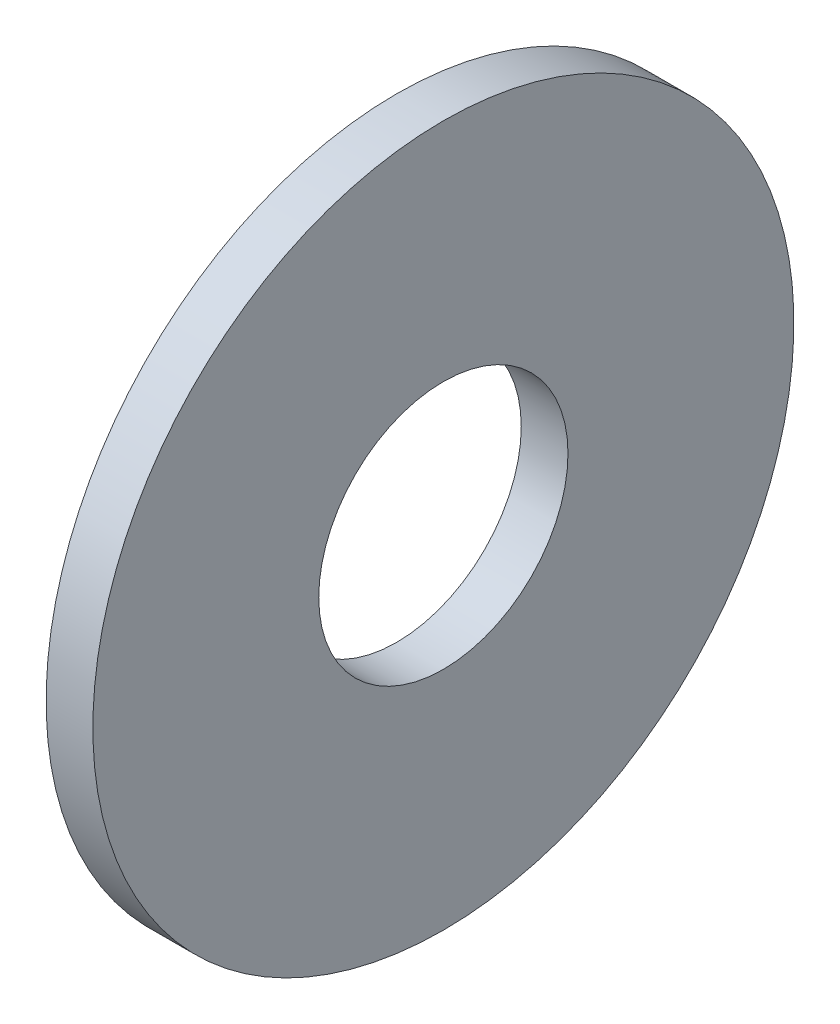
ISO-10303-21;
HEADER;
FILE_DESCRIPTION(('STEP AP214'),'2;1');
FILE_NAME('part.step','',(''),(''),'','','');
FILE_SCHEMA(('AUTOMOTIVE_DESIGN { 1 0 10303 214 1 1 1 1 }'));
ENDSEC;
DATA;
#1=APPLICATION_CONTEXT('core data for automotive mechanical design processes');
#2=APPLICATION_PROTOCOL_DEFINITION('international standard','automotive_design',2000,#1);
#3=PRODUCT_CONTEXT('',#1,'mechanical');
#4=PRODUCT('Part','Part','',(#3));
#5=PRODUCT_RELATED_PRODUCT_CATEGORY('part','',(#4));
#6=PRODUCT_DEFINITION_FORMATION('','',#4);
#7=PRODUCT_DEFINITION_CONTEXT('part definition',#1,'design');
#8=PRODUCT_DEFINITION('design','',#6,#7);
#9=PRODUCT_DEFINITION_SHAPE('','',#8);
#10=(LENGTH_UNIT() NAMED_UNIT(*) SI_UNIT(.MILLI.,.METRE.));
#11=(NAMED_UNIT(*) PLANE_ANGLE_UNIT() SI_UNIT($,.RADIAN.));
#12=(NAMED_UNIT(*) SI_UNIT($,.STERADIAN.) SOLID_ANGLE_UNIT());
#13=UNCERTAINTY_MEASURE_WITH_UNIT(LENGTH_MEASURE(1.E-05),#10,'distance_accuracy_value','');
#14=(GEOMETRIC_REPRESENTATION_CONTEXT(3) GLOBAL_UNCERTAINTY_ASSIGNED_CONTEXT((#13)) GLOBAL_UNIT_ASSIGNED_CONTEXT((#10,
#11,#12)) REPRESENTATION_CONTEXT('',''));
#15=CARTESIAN_POINT('',(0.,0.,0.));
#16=DIRECTION('',(0.,0.,1.));
#17=DIRECTION('',(1.,0.,0.));
#18=AXIS2_PLACEMENT_3D('',#15,#16,#17);
#19=CARTESIAN_POINT('',(0.,3.20000000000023,9.99200722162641E-13));
#20=DIRECTION('',(-1.,0.,0.));
#21=DIRECTION('',(0.,-1.,0.));
#22=AXIS2_PLACEMENT_3D('',#19,#20,#21);
#23=PLANE('',#22);
#24=CARTESIAN_POINT('',(0.,-2.56739074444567E-12,8.74300631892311E-13));
#25=DIRECTION('',(-1.,0.,0.));
#26=DIRECTION('',(0.,-1.,0.));
#27=AXIS2_PLACEMENT_3D('',#24,#25,#26);
#28=CIRCLE('',#27,3.20000000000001);
#29=CARTESIAN_POINT('',(0.,-3.20000000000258,8.74300631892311E-13));
#30=VERTEX_POINT('',#29);
#31=EDGE_CURVE('E25',#30,#30,#28,.T.);
#32=ORIENTED_EDGE('',*,*,#31,.T.);
#33=EDGE_LOOP('',(#32));
#34=FACE_BOUND('',#33,.T.);
#35=CARTESIAN_POINT('',(0.,-2.56739074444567E-12,8.74300631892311E-13));
#36=DIRECTION('',(-1.,0.,0.));
#37=DIRECTION('',(0.,-1.,0.));
#38=AXIS2_PLACEMENT_3D('',#35,#36,#37);
#39=CIRCLE('',#38,9.00000000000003);
#40=CARTESIAN_POINT('',(0.,-9.0000000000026,8.74300631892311E-13));
#41=VERTEX_POINT('',#40);
#42=EDGE_CURVE('E34',#41,#41,#39,.T.);
#43=ORIENTED_EDGE('',*,*,#42,.F.);
#44=EDGE_LOOP('',(#43));
#45=FACE_BOUND('',#44,.T.);
#46=ADVANCED_FACE('F22',(#34,#45),#23,.F.);
#47=CARTESIAN_POINT('',(-34.9249999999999,-2.55351295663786E-12,8.32667268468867E-13));
#48=DIRECTION('',(-1.,0.,0.));
#49=DIRECTION('',(0.,-1.,0.));
#50=AXIS2_PLACEMENT_3D('',#47,#48,#49);
#51=CYLINDRICAL_SURFACE('',#50,3.20000000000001);
#52=ORIENTED_EDGE('',*,*,#31,.F.);
#53=EDGE_LOOP('',(#52));
#54=FACE_BOUND('',#53,.T.);
#55=CARTESIAN_POINT('',(-1.20000000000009,-2.5951463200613E-12,7.7715611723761E-13));
#56=DIRECTION('',(-1.,0.,0.));
#57=DIRECTION('',(0.,-1.,0.));
#58=AXIS2_PLACEMENT_3D('',#55,#56,#57);
#59=CIRCLE('',#58,3.20000000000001);
#60=CARTESIAN_POINT('',(-1.20000000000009,-3.20000000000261,7.7715611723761E-13));
#61=VERTEX_POINT('',#60);
#62=EDGE_CURVE('E29',#61,#61,#59,.T.);
#63=ORIENTED_EDGE('',*,*,#62,.T.);
#64=EDGE_LOOP('',(#63));
#65=FACE_BOUND('',#64,.T.);
#66=ADVANCED_FACE('F44',(#54,#65),#51,.F.);
#67=CARTESIAN_POINT('',(-34.9249999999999,-2.55351295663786E-12,8.32667268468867E-13));
#68=DIRECTION('',(-1.,0.,0.));
#69=DIRECTION('',(0.,-1.,0.));
#70=AXIS2_PLACEMENT_3D('',#67,#68,#69);
#71=CYLINDRICAL_SURFACE('',#70,9.00000000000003);
#72=CARTESIAN_POINT('',(-1.20000000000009,-2.5951463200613E-12,7.7715611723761E-13));
#73=DIRECTION('',(-1.,0.,0.));
#74=DIRECTION('',(0.,-1.,0.));
#75=AXIS2_PLACEMENT_3D('',#72,#73,#74);
#76=CIRCLE('',#75,9.00000000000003);
#77=CARTESIAN_POINT('',(-1.20000000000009,-9.00000000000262,7.7715611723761E-13));
#78=VERTEX_POINT('',#77);
#79=EDGE_CURVE('E12',#78,#78,#76,.F.);
#80=ORIENTED_EDGE('',*,*,#79,.T.);
#81=EDGE_LOOP('',(#80));
#82=FACE_BOUND('',#81,.T.);
#83=ORIENTED_EDGE('',*,*,#42,.T.);
#84=EDGE_LOOP('',(#83));
#85=FACE_BOUND('',#84,.T.);
#86=ADVANCED_FACE('F47',(#82,#85),#71,.T.);
#87=CARTESIAN_POINT('',(-1.20000000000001,9.00000000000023,2.22044604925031E-13));
#88=DIRECTION('',(1.,0.,0.));
#89=DIRECTION('',(0.,1.,0.));
#90=AXIS2_PLACEMENT_3D('',#87,#88,#89);
#91=PLANE('',#90);
#92=ORIENTED_EDGE('',*,*,#79,.F.);
#93=EDGE_LOOP('',(#92));
#94=FACE_BOUND('',#93,.T.);
#95=ORIENTED_EDGE('',*,*,#62,.F.);
#96=EDGE_LOOP('',(#95));
#97=FACE_BOUND('',#96,.T.);
#98=ADVANCED_FACE('F50',(#94,#97),#91,.F.);
#99=CLOSED_SHELL('',(#46,#66,#86,#98));
#100=MANIFOLD_SOLID_BREP('B1',#99);
#101=ADVANCED_BREP_SHAPE_REPRESENTATION('',(#18,#100),#14);
#102=SHAPE_DEFINITION_REPRESENTATION(#9,#101);
ENDSEC;
END-ISO-10303-21;
